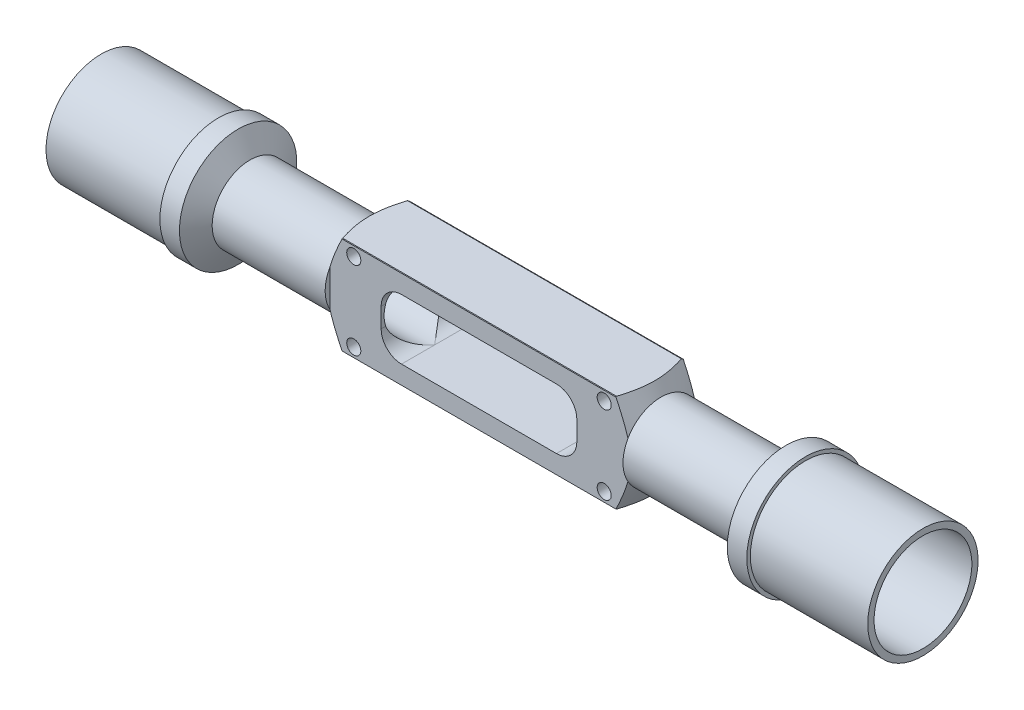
from build123d import *

# Parameters (mm, degrees)
CUT_EXTRUDE1_DEPTH             = 137.044211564
CUT_EXTRUDE1_DEPTH_BACK        = 137.044211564
SKETCH2_W                      = 96.672289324
SKETCH2_H                      = 12.7
CUT_EXTRUDE2_DEPTH             = 25.4
SKETCH4_R                      = 2.286
CUT_EXTRUDE3_DEPTH             = 138.956742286
CUT_EXTRUDE7_REACH             = 138.044
SKETCH7_W                      = 38.1
SKETCH7_H                      = 6.35
CUT_EXTRUDE7_DIRECTION_2_REACH = 138.044
CUT_EXTRUDE8_DEPTH             = 137.044211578
CUT_EXTRUDE8_DEPTH_BACK        = 137.044211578
SKETCH10_W                     = 96.672289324
SKETCH10_H                     = 12.7
SKETCH11_R                     = 19.05
SKETCH11_R_2                   = 17.907
CUT_EXTRUDE9_DEPTH             = 3.175
CUT_EXTRUDE10_START            = -3.175
SKETCH12_R                     = 19.05
SKETCH12_R_2                   = 17.907
CUT_EXTRUDE10_DEPTH            = 3.175


with BuildPart() as part:
    # Sketch1 → Revolve1 (revolve)
    with BuildSketch(Plane.XY, mode=Mode.PRIVATE) as revolve1_sk:
        Polygon((-133.35, 17.907), (-98.425, 17.907), (-98.425, 19.05), (-88.9, 19.05), (-85.013855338, 12.319), (-48.336144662, 12.319), (-44.45, 19.05), (44.45, 19.05), (48.336144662, 12.319), (85.013855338, 12.319), (88.9, 19.05), (98.425, 19.05), (98.425, 17.907), (133.35, 17.907), (133.35, 15.875), (91.948, 15.875), (91.948, 9.779), (-91.948, 9.779), (-91.948, 15.875), (-133.35, 15.875), align=None)
    revolve(revolve1_sk.sketch.rotate(Axis((-211.766779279, 0, 0), (1, 0, 0)), 90), axis=Axis((-211.766779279, 0, 0), (1, 0, 0)))

    # Sketch2 → Cut-Extrude1 (cut, two sides: drawn at the far end of the back side and taken through both)
    with BuildSketch(Plane(origin=(0, 0, 0), x_dir=(1, 0, 0), z_dir=(0, 1, 0)).offset(-CUT_EXTRUDE1_DEPTH_BACK)):
        with Locations((0, -17.0815)):
            Rectangle(SKETCH2_W, SKETCH2_H)
    extrude(amount=CUT_EXTRUDE1_DEPTH + CUT_EXTRUDE1_DEPTH_BACK, mode=Mode.SUBTRACT)

    # Sketch3 → Cut-Extrude2 (cut)
    with BuildSketch(Plane.XY.offset(10.7315)):
        with BuildLine():
            Line((-31.75, -3.175), (-31.75, 3.175))
            ThreePointArc((-31.75, 3.175), (-29.815733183, 7.844733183), (-25.146, 9.779))
            Line((-25.146, 9.779), (25.146, 9.779))
            ThreePointArc((25.146, 9.779), (29.815733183, 7.844733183), (31.75, 3.175))
            Line((31.75, 3.175), (31.75, -3.175))
            ThreePointArc((31.75, -3.175), (29.815733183, -7.844733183), (25.146, -9.779))
            Line((25.146, -9.779), (-25.146, -9.779))
            ThreePointArc((-25.146, -9.779), (-29.815733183, -7.844733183), (-31.75, -3.175))
        make_face()
    extrude(amount=-CUT_EXTRUDE2_DEPTH, mode=Mode.SUBTRACT)

    # Sketch4 → Cut-Extrude3 (cut, through all)
    with BuildSketch(Plane.XY.offset(10.7315)):
        with Locations((-40.64, 12.7)):
            Circle(SKETCH4_R)
        with Locations((-40.64, -12.7)):
            Circle(SKETCH4_R)
        with Locations((40.64, -12.7)):
            Circle(SKETCH4_R)
        with Locations((40.64, 12.7)):
            Circle(SKETCH4_R)
    extrude(amount=-CUT_EXTRUDE3_DEPTH, mode=Mode.SUBTRACT)

    # Sketch7 → Cut-Extrude7 (cut, up to next)
    with BuildSketch(Plane(origin=(0, 0, 0), x_dir=(0, 0, -1), z_dir=(1, 0, 0)), mode=Mode.PRIVATE) as cut_extrude7_sk1:
        with Locations((0, -19.05)):
            Rectangle(SKETCH7_W, SKETCH7_H)
    cut_extrude7_tool1 = extrude(cut_extrude7_sk1.sketch, amount=-CUT_EXTRUDE7_REACH, mode=Mode.PRIVATE) & part.part
    # Sketch7 → Cut-Extrude7 (cut, up to next)
    with BuildSketch(Plane(origin=(0, 0, 0), x_dir=(0, 0, -1), z_dir=(1, 0, 0)), mode=Mode.PRIVATE) as cut_extrude7_sk2:
        with Locations((0, 19.05)):
            Rectangle(SKETCH7_W, SKETCH7_H)
    cut_extrude7_tool2 = extrude(cut_extrude7_sk2.sketch, amount=-CUT_EXTRUDE7_REACH, mode=Mode.PRIVATE) & part.part
    add(cut_extrude7_tool1.solids().sort_by_distance((0, -19.05, 0))[0], mode=Mode.SUBTRACT)
    add(cut_extrude7_tool2.solids().sort_by_distance((0, 19.05, 0))[0], mode=Mode.SUBTRACT)

    # Sketch7 → Cut-Extrude7 direction 2 (cut, up to next)
    with BuildSketch(Plane(origin=(0, 0, 0), x_dir=(0, 0, -1), z_dir=(1, 0, 0)), mode=Mode.PRIVATE) as cut_extrude7_direction_2_sk1:
        with Locations((0, -19.05)):
            Rectangle(SKETCH7_W, SKETCH7_H)
    cut_extrude7_direction_2_tool1 = extrude(cut_extrude7_direction_2_sk1.sketch, amount=CUT_EXTRUDE7_DIRECTION_2_REACH, mode=Mode.PRIVATE) & part.part
    # Sketch7 → Cut-Extrude7 direction 2 (cut, up to next)
    with BuildSketch(Plane(origin=(0, 0, 0), x_dir=(0, 0, -1), z_dir=(1, 0, 0)), mode=Mode.PRIVATE) as cut_extrude7_direction_2_sk2:
        with Locations((0, 19.05)):
            Rectangle(SKETCH7_W, SKETCH7_H)
    cut_extrude7_direction_2_tool2 = extrude(cut_extrude7_direction_2_sk2.sketch, amount=CUT_EXTRUDE7_DIRECTION_2_REACH, mode=Mode.PRIVATE) & part.part
    add(cut_extrude7_direction_2_tool1.solids().sort_by_distance((0, -19.05, 0))[0], mode=Mode.SUBTRACT)
    add(cut_extrude7_direction_2_tool2.solids().sort_by_distance((0, 19.05, 0))[0], mode=Mode.SUBTRACT)

    # Sketch10 → Cut-Extrude8 (cut, two sides: drawn at the far end of the back side and taken through both)
    with BuildSketch(Plane(origin=(0, 0, 0), x_dir=(1, 0, 0), z_dir=(0, 1, 0)).offset(-CUT_EXTRUDE8_DEPTH_BACK)):
        with Locations((0, 17.4625)):
            Rectangle(SKETCH10_W, SKETCH10_H)
    extrude(amount=CUT_EXTRUDE8_DEPTH + CUT_EXTRUDE8_DEPTH_BACK, mode=Mode.SUBTRACT)

    # Sketch11 → Cut-Extrude9 (cut)
    with BuildSketch(Plane(origin=(98.425, 0, 0), x_dir=(0, 0, -1), z_dir=(1, 0, 0))):
        with Locations(Location((0, 0, 0), (0, 0, 180))):
            Circle(SKETCH11_R)
        with Locations(Location((0, 0, 0), (0, 0, 180))):
            Circle(SKETCH11_R_2, mode=Mode.SUBTRACT)
    extrude(amount=-CUT_EXTRUDE9_DEPTH, mode=Mode.SUBTRACT)

    # Sketch12 → Cut-Extrude10 (cut)
    with BuildSketch(Plane.ZY.offset(98.425).offset(CUT_EXTRUDE10_START)):
        Circle(SKETCH12_R)
        Circle(SKETCH12_R_2, mode=Mode.SUBTRACT)
    extrude(amount=CUT_EXTRUDE10_DEPTH, mode=Mode.SUBTRACT)


solid = part.part
